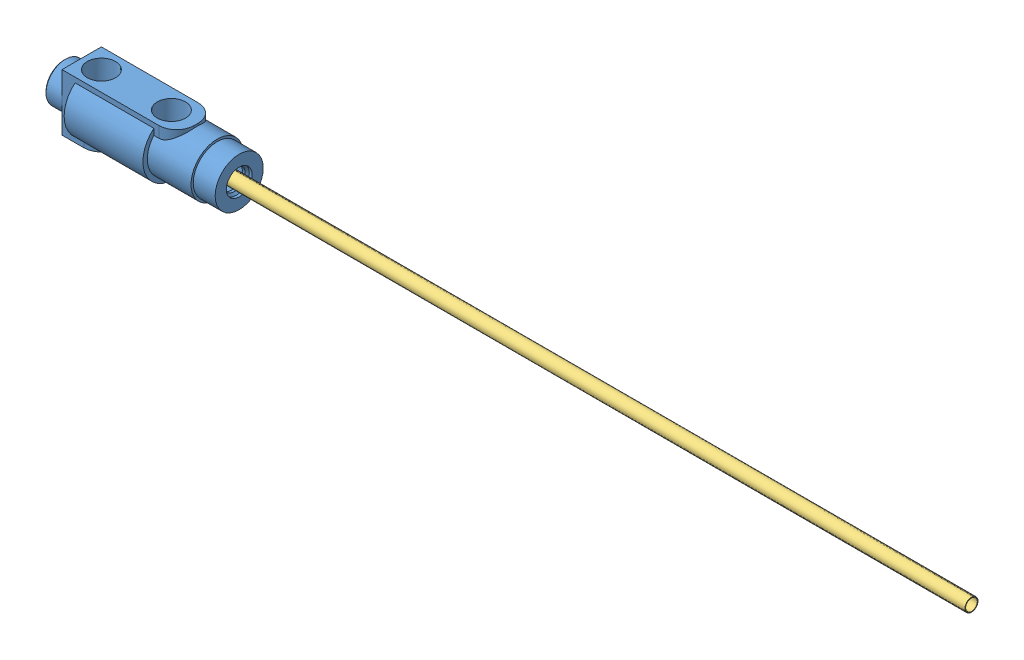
SolidWorks assembly RLQC1815.sldasm, configuration Default (file format 13000). Lengths in mm.
Overall size (329.18 21.42 22.23).
4 component instances, 3 part files, 4 mates.
Components (placement in the parent):
- RLQCH1815-1: RLQCH1815.SLDPRT [Default] at origin size (63.5 21.42 22.23)
- BR12-1: BR12.sldprt [Default] at (-63.5 0 0) x (0 0.999551 0.029964) z (0 -0.029964 0.999551) size (10.25 6.35 10.25)
- BR12-2: BR12.sldprt [Default] at (-49.9872 -10.3124 0) x (0.684499 0 -0.729014) z (-0.729014 0 -0.684499) size (10.25 6.35 10.25)
- PT06-187L12-1: PT06-187L12.SLDPRT [PT06-187L12] at (-39.116 0 0) x (0 -0.852197 -0.52322) z (0 -0.52322 0.852197) size (7.76 304.8 7.76)
Mates (geometry in assembly coordinates):
- ProfileCenter2: profile center: plane of BR12-1 through (-63.5 0 0) normal (-1 0 0); circle of RLQCH1815-1
- ProfileCenter3: profile center: plane of BR12-2 through (-49.9872 -10.3124 0) normal (0 -1 0); circle of RLQCH1815-1
- Distance1: distance = 39.116 mm: plane of RLQCH1815-1 through (0 4.3656 0) normal (1 0 0); plane of PT06-187L12-1 through (-39.116 0 0) normal (-1 0 0)
- Concentric1: concentric aligned: cylinder of RLQCH1815-1 through (-4.7244 0 0) axis (1 0 0) radius 8.7312; cylinder of PT06-187L12-1 through (-39.116 0 0) axis (1 0 0) radius 2.3749
